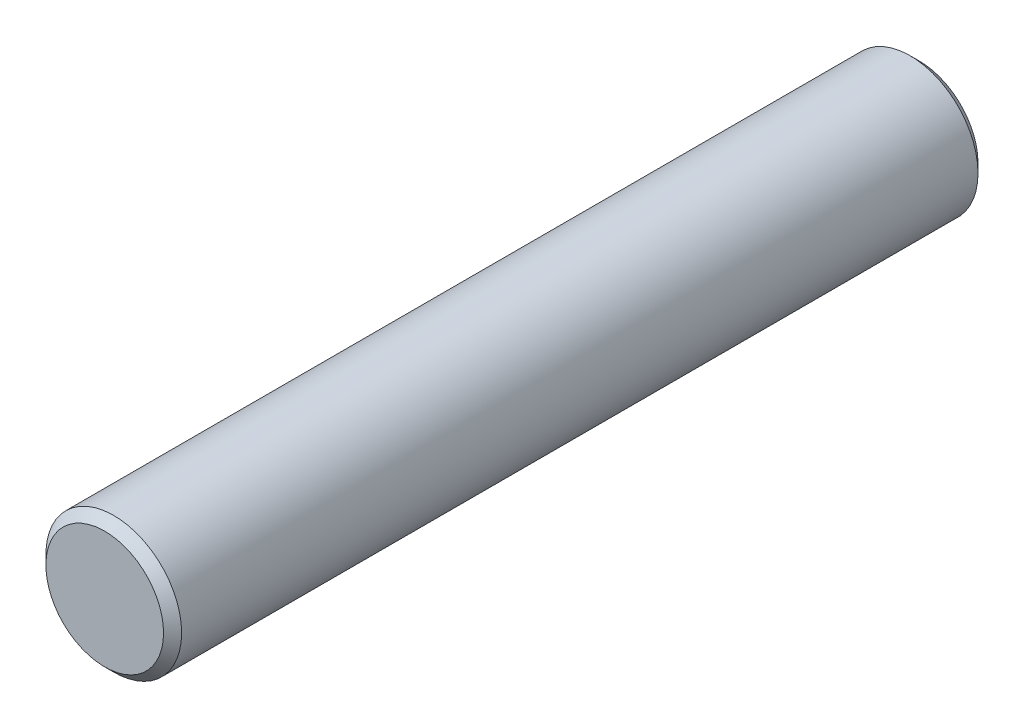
ISO-10303-21;
HEADER;
FILE_DESCRIPTION(('STEP AP214'),'2;1');
FILE_NAME('part.step','',(''),(''),'','','');
FILE_SCHEMA(('AUTOMOTIVE_DESIGN { 1 0 10303 214 1 1 1 1 }'));
ENDSEC;
DATA;
#1=APPLICATION_CONTEXT('core data for automotive mechanical design processes');
#2=APPLICATION_PROTOCOL_DEFINITION('international standard','automotive_design',2000,#1);
#3=PRODUCT_CONTEXT('',#1,'mechanical');
#4=PRODUCT('Part','Part','',(#3));
#5=PRODUCT_RELATED_PRODUCT_CATEGORY('part','',(#4));
#6=PRODUCT_DEFINITION_FORMATION('','',#4);
#7=PRODUCT_DEFINITION_CONTEXT('part definition',#1,'design');
#8=PRODUCT_DEFINITION('design','',#6,#7);
#9=PRODUCT_DEFINITION_SHAPE('','',#8);
#10=(LENGTH_UNIT() NAMED_UNIT(*) SI_UNIT(.MILLI.,.METRE.));
#11=(NAMED_UNIT(*) PLANE_ANGLE_UNIT() SI_UNIT($,.RADIAN.));
#12=(NAMED_UNIT(*) SI_UNIT($,.STERADIAN.) SOLID_ANGLE_UNIT());
#13=UNCERTAINTY_MEASURE_WITH_UNIT(LENGTH_MEASURE(1.E-05),#10,'distance_accuracy_value','');
#14=(GEOMETRIC_REPRESENTATION_CONTEXT(3) GLOBAL_UNCERTAINTY_ASSIGNED_CONTEXT((#13)) GLOBAL_UNIT_ASSIGNED_CONTEXT((#10,
#11,#12)) REPRESENTATION_CONTEXT('',''));
#15=CARTESIAN_POINT('',(0.,0.,0.));
#16=DIRECTION('',(0.,0.,1.));
#17=DIRECTION('',(1.,0.,0.));
#18=AXIS2_PLACEMENT_3D('',#15,#16,#17);
#19=CARTESIAN_POINT('',(0.,0.,-18.));
#20=DIRECTION('',(0.,0.,1.));
#21=DIRECTION('',(1.,0.,0.));
#22=AXIS2_PLACEMENT_3D('',#19,#20,#21);
#23=CYLINDRICAL_SURFACE('',#22,1.5);
#24=CARTESIAN_POINT('',(0.,0.,-17.8));
#25=DIRECTION('',(0.,0.,1.));
#26=DIRECTION('',(1.,0.,0.));
#27=AXIS2_PLACEMENT_3D('',#24,#25,#26);
#28=CIRCLE('',#27,1.5);
#29=CARTESIAN_POINT('',(1.5,0.,-17.8));
#30=VERTEX_POINT('',#29);
#31=EDGE_CURVE('E41',#30,#30,#28,.T.);
#32=ORIENTED_EDGE('',*,*,#31,.T.);
#33=EDGE_LOOP('',(#32));
#34=FACE_BOUND('',#33,.T.);
#35=CARTESIAN_POINT('',(0.,0.,-0.199999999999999));
#36=DIRECTION('',(0.,0.,1.));
#37=DIRECTION('',(1.,0.,0.));
#38=AXIS2_PLACEMENT_3D('',#35,#36,#37);
#39=CIRCLE('',#38,1.5);
#40=CARTESIAN_POINT('',(1.5,0.,-0.199999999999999));
#41=VERTEX_POINT('',#40);
#42=EDGE_CURVE('E45',#41,#41,#39,.F.);
#43=ORIENTED_EDGE('',*,*,#42,.T.);
#44=EDGE_LOOP('',(#43));
#45=FACE_BOUND('',#44,.T.);
#46=ADVANCED_FACE('F31',(#34,#45),#23,.T.);
#47=CARTESIAN_POINT('',(0.,0.,-18.));
#48=DIRECTION('',(0.,0.,1.));
#49=DIRECTION('',(1.,0.,0.));
#50=AXIS2_PLACEMENT_3D('',#47,#48,#49);
#51=PLANE('',#50);
#52=CARTESIAN_POINT('',(0.,0.,-18.));
#53=DIRECTION('',(0.,0.,1.));
#54=DIRECTION('',(1.,0.,0.));
#55=AXIS2_PLACEMENT_3D('',#52,#53,#54);
#56=CIRCLE('',#55,1.29999999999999);
#57=CARTESIAN_POINT('',(1.29999999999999,0.,-18.));
#58=VERTEX_POINT('',#57);
#59=EDGE_CURVE('E37',#58,#58,#56,.F.);
#60=ORIENTED_EDGE('',*,*,#59,.T.);
#61=EDGE_LOOP('',(#60));
#62=FACE_BOUND('',#61,.T.);
#63=ADVANCED_FACE('F64',(#62),#51,.F.);
#64=CARTESIAN_POINT('',(0.,0.,0.));
#65=DIRECTION('',(0.,0.,1.));
#66=DIRECTION('',(1.,0.,0.));
#67=AXIS2_PLACEMENT_3D('',#64,#65,#66);
#68=PLANE('',#67);
#69=CARTESIAN_POINT('',(0.,0.,0.));
#70=DIRECTION('',(0.,0.,1.));
#71=DIRECTION('',(1.,0.,0.));
#72=AXIS2_PLACEMENT_3D('',#69,#70,#71);
#73=CIRCLE('',#72,1.3);
#74=CARTESIAN_POINT('',(1.3,0.,0.));
#75=VERTEX_POINT('',#74);
#76=EDGE_CURVE('E10',#75,#75,#73,.T.);
#77=ORIENTED_EDGE('',*,*,#76,.T.);
#78=EDGE_LOOP('',(#77));
#79=FACE_BOUND('',#78,.T.);
#80=ADVANCED_FACE('F60',(#79),#68,.T.);
#81=CARTESIAN_POINT('',(0.,0.,-17.8));
#82=DIRECTION('',(0.,0.,1.));
#83=DIRECTION('',(1.,0.,0.));
#84=AXIS2_PLACEMENT_3D('',#81,#82,#83);
#85=CONICAL_SURFACE('',#84,1.5,0.785398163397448);
#86=ORIENTED_EDGE('',*,*,#59,.F.);
#87=EDGE_LOOP('',(#86));
#88=FACE_BOUND('',#87,.T.);
#89=ORIENTED_EDGE('',*,*,#31,.F.);
#90=EDGE_LOOP('',(#89));
#91=FACE_BOUND('',#90,.T.);
#92=ADVANCED_FACE('F55',(#88,#91),#85,.T.);
#93=CARTESIAN_POINT('',(0.,0.,0.));
#94=DIRECTION('',(0.,0.,-1.));
#95=DIRECTION('',(-1.,0.,0.));
#96=AXIS2_PLACEMENT_3D('',#93,#94,#95);
#97=CONICAL_SURFACE('',#96,1.3,0.785398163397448);
#98=ORIENTED_EDGE('',*,*,#42,.F.);
#99=EDGE_LOOP('',(#98));
#100=FACE_BOUND('',#99,.T.);
#101=ORIENTED_EDGE('',*,*,#76,.F.);
#102=EDGE_LOOP('',(#101));
#103=FACE_BOUND('',#102,.T.);
#104=ADVANCED_FACE('F52',(#100,#103),#97,.T.);
#105=CLOSED_SHELL('',(#46,#63,#80,#92,#104));
#106=MANIFOLD_SOLID_BREP('B2',#105);
#107=ADVANCED_BREP_SHAPE_REPRESENTATION('',(#18,#106),#14);
#108=SHAPE_DEFINITION_REPRESENTATION(#9,#107);
ENDSEC;
END-ISO-10303-21;
